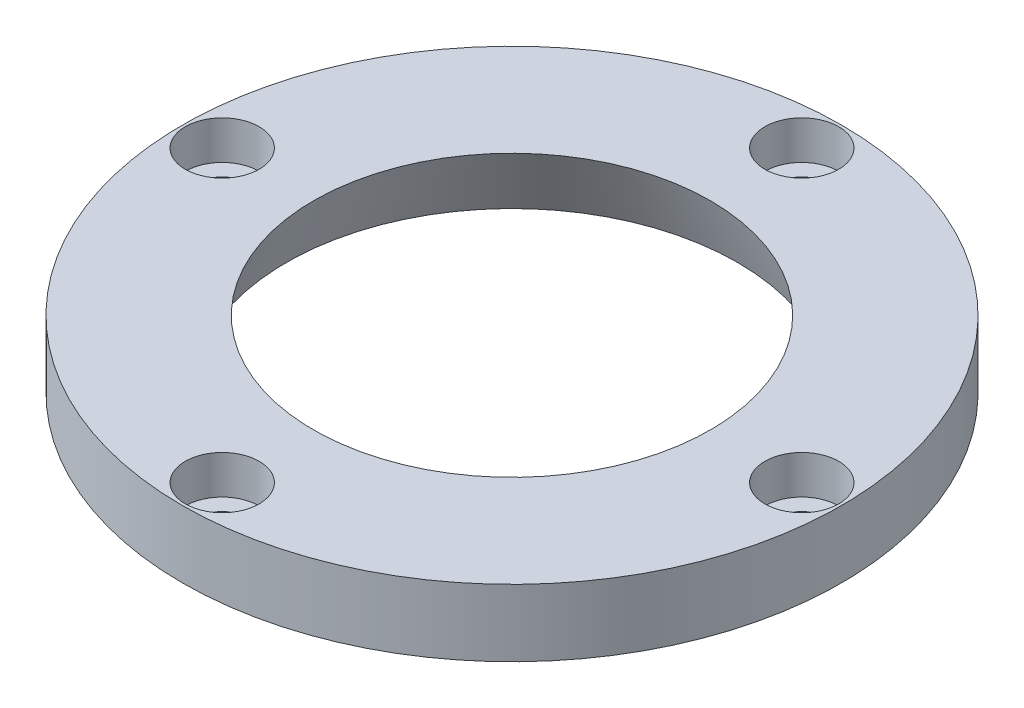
from build123d import *

# Parameters (mm, degrees)
CHAMBRAGE_POUR_VIS_T_TE_HEXAGONALE_M31_D           = 3.4
CHAMBRAGE_POUR_VIS_T_TE_HEXAGONALE_M31_CBORE_D     = 6.5
CHAMBRAGE_POUR_VIS_T_TE_HEXAGONALE_M31_CBORE_DEPTH = 3.4
R_P_TITION_CIRCULAIRE1_COUNT                       = 4


with BuildPart() as part:
    # Esquisse1 → R_volution1 (revolve)
    with BuildSketch(Plane.XY, mode=Mode.PRIVATE) as r_volution1_sk:
        Polygon((-19.85, 0), (-29, 0), (-29, 5.9), (-17.466245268, 5.9), align=None)
    revolve(r_volution1_sk.sketch.rotate(Axis((0, 0, 0), (0, 1, 0)), 270), axis=Axis((0, 0, 0), (0, 1, 0)))

    # Chambrage pour vis _ t_te hexagonale M31 (through all)
    with Locations(Plane(origin=(0, 5.9, 0), x_dir=(1, 0, 0), z_dir=(0, 1, 0))):
        with Locations((0, -25.5)):
            chambrage_pour_vis_t_te_hexagonale_m31 = CounterBoreHole(CHAMBRAGE_POUR_VIS_T_TE_HEXAGONALE_M31_D / 2, CHAMBRAGE_POUR_VIS_T_TE_HEXAGONALE_M31_CBORE_D / 2, CHAMBRAGE_POUR_VIS_T_TE_HEXAGONALE_M31_CBORE_DEPTH)

    # R_p_tition circulaire1: Chambrage pour vis _ t_te hexagonale M31 ×4 about axis
    r_p_tition_circulaire1_axis = Axis((0, 0, 0), (0, 1, 0))
    for i in range(1, R_P_TITION_CIRCULAIRE1_COUNT):
        add(chambrage_pour_vis_t_te_hexagonale_m31.rotate(r_p_tition_circulaire1_axis, i * 360 / R_P_TITION_CIRCULAIRE1_COUNT), mode=Mode.SUBTRACT)


solid = part.part
